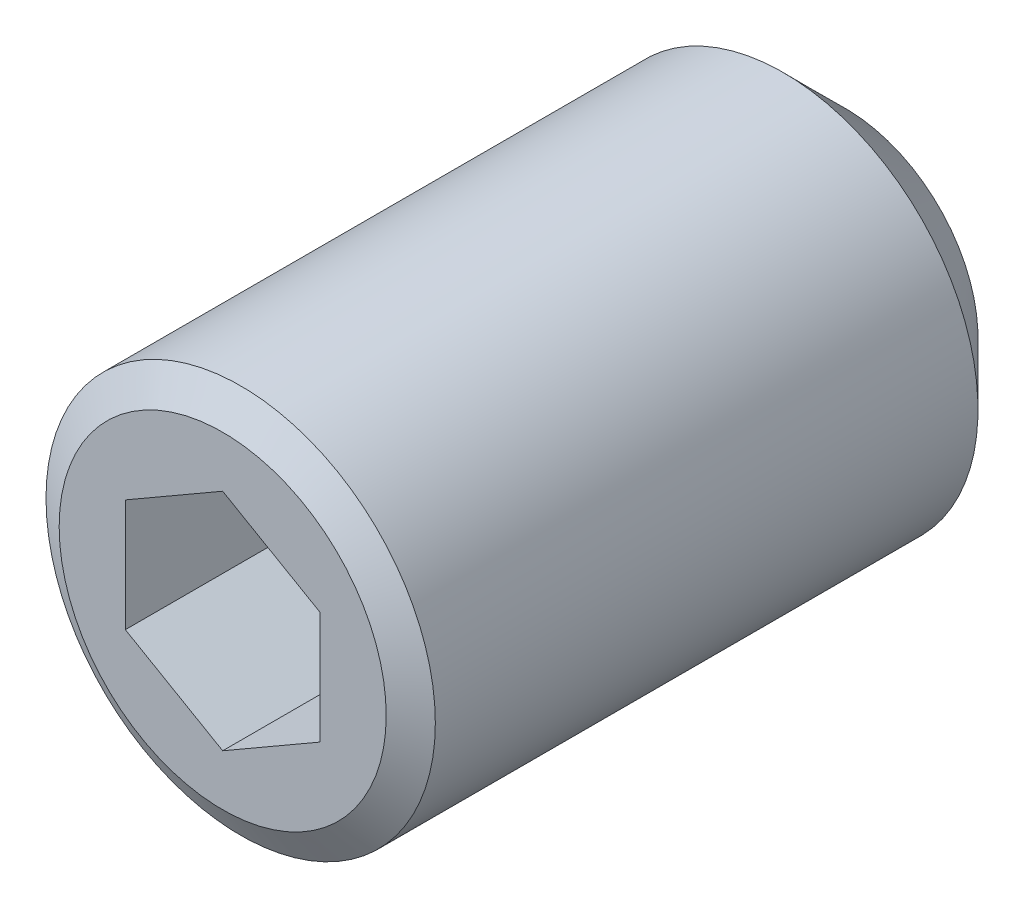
ISO-10303-21;
HEADER;
FILE_DESCRIPTION(('STEP AP214'),'2;1');
FILE_NAME('part.step','',(''),(''),'','','');
FILE_SCHEMA(('AUTOMOTIVE_DESIGN { 1 0 10303 214 1 1 1 1 }'));
ENDSEC;
DATA;
#1=APPLICATION_CONTEXT('core data for automotive mechanical design processes');
#2=APPLICATION_PROTOCOL_DEFINITION('international standard','automotive_design',2000,#1);
#3=PRODUCT_CONTEXT('',#1,'mechanical');
#4=PRODUCT('Part','Part','',(#3));
#5=PRODUCT_RELATED_PRODUCT_CATEGORY('part','',(#4));
#6=PRODUCT_DEFINITION_FORMATION('','',#4);
#7=PRODUCT_DEFINITION_CONTEXT('part definition',#1,'design');
#8=PRODUCT_DEFINITION('design','',#6,#7);
#9=PRODUCT_DEFINITION_SHAPE('','',#8);
#10=(LENGTH_UNIT() NAMED_UNIT(*) SI_UNIT(.MILLI.,.METRE.));
#11=(NAMED_UNIT(*) PLANE_ANGLE_UNIT() SI_UNIT($,.RADIAN.));
#12=(NAMED_UNIT(*) SI_UNIT($,.STERADIAN.) SOLID_ANGLE_UNIT());
#13=UNCERTAINTY_MEASURE_WITH_UNIT(LENGTH_MEASURE(1.E-05),#10,'distance_accuracy_value','');
#14=(GEOMETRIC_REPRESENTATION_CONTEXT(3) GLOBAL_UNCERTAINTY_ASSIGNED_CONTEXT((#13)) GLOBAL_UNIT_ASSIGNED_CONTEXT((#10,
#11,#12)) REPRESENTATION_CONTEXT('',''));
#15=CARTESIAN_POINT('',(0.,0.,0.));
#16=DIRECTION('',(0.,0.,1.));
#17=DIRECTION('',(1.,0.,0.));
#18=AXIS2_PLACEMENT_3D('',#15,#16,#17);
#19=CARTESIAN_POINT('',(0.,0.,8.));
#20=DIRECTION('',(0.,0.,1.));
#21=DIRECTION('',(1.,0.,0.));
#22=AXIS2_PLACEMENT_3D('',#19,#20,#21);
#23=PLANE('',#22);
#24=DIRECTION('',(0.866025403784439,-0.5,0.));
#25=VECTOR('',#24,1.);
#26=CARTESIAN_POINT('',(-1.25,-0.721687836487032,8.));
#27=LINE('',#26,#25);
#28=CARTESIAN_POINT('',(-1.25,-0.721687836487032,8.));
#29=VERTEX_POINT('',#28);
#30=CARTESIAN_POINT('',(0.,-1.44337567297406,8.));
#31=VERTEX_POINT('',#30);
#32=EDGE_CURVE('E29',#29,#31,#27,.T.);
#33=ORIENTED_EDGE('',*,*,#32,.F.);
#34=DIRECTION('',(0.,-1.,0.));
#35=VECTOR('',#34,1.);
#36=CARTESIAN_POINT('',(-1.25,0.721687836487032,8.));
#37=LINE('',#36,#35);
#38=CARTESIAN_POINT('',(-1.25,0.721687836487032,8.));
#39=VERTEX_POINT('',#38);
#40=EDGE_CURVE('E112',#39,#29,#37,.T.);
#41=ORIENTED_EDGE('',*,*,#40,.F.);
#42=DIRECTION('',(-0.866025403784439,-0.5,0.));
#43=VECTOR('',#42,1.);
#44=CARTESIAN_POINT('',(0.,1.44337567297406,8.));
#45=LINE('',#44,#43);
#46=CARTESIAN_POINT('',(0.,1.44337567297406,8.));
#47=VERTEX_POINT('',#46);
#48=EDGE_CURVE('E110',#47,#39,#45,.T.);
#49=ORIENTED_EDGE('',*,*,#48,.F.);
#50=DIRECTION('',(-0.866025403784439,0.5,0.));
#51=VECTOR('',#50,1.);
#52=CARTESIAN_POINT('',(1.25,0.721687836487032,8.));
#53=LINE('',#52,#51);
#54=CARTESIAN_POINT('',(1.25,0.721687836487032,8.));
#55=VERTEX_POINT('',#54);
#56=EDGE_CURVE('E77',#55,#47,#53,.T.);
#57=ORIENTED_EDGE('',*,*,#56,.F.);
#58=DIRECTION('',(0.,1.,0.));
#59=VECTOR('',#58,1.);
#60=CARTESIAN_POINT('',(1.25,-0.721687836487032,8.));
#61=LINE('',#60,#59);
#62=CARTESIAN_POINT('',(1.25,-0.721687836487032,8.));
#63=VERTEX_POINT('',#62);
#64=EDGE_CURVE('E106',#63,#55,#61,.T.);
#65=ORIENTED_EDGE('',*,*,#64,.F.);
#66=DIRECTION('',(0.866025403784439,0.5,0.));
#67=VECTOR('',#66,1.);
#68=CARTESIAN_POINT('',(0.,-1.44337567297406,8.));
#69=LINE('',#68,#67);
#70=EDGE_CURVE('E103',#31,#63,#69,.T.);
#71=ORIENTED_EDGE('',*,*,#70,.F.);
#72=EDGE_LOOP('',(#33,#41,#49,#57,#65,#71));
#73=FACE_BOUND('',#72,.T.);
#74=CARTESIAN_POINT('',(0.,0.,8.));
#75=DIRECTION('',(0.,0.,1.));
#76=DIRECTION('',(1.,0.,0.));
#77=AXIS2_PLACEMENT_3D('',#74,#75,#76);
#78=CIRCLE('',#77,2.1);
#79=CARTESIAN_POINT('',(2.1,0.,8.));
#80=VERTEX_POINT('',#79);
#81=EDGE_CURVE('E9',#80,#80,#78,.T.);
#82=ORIENTED_EDGE('',*,*,#81,.T.);
#83=EDGE_LOOP('',(#82));
#84=FACE_BOUND('',#83,.T.);
#85=ADVANCED_FACE('F14',(#73,#84),#23,.T.);
#86=CARTESIAN_POINT('',(0.,0.,-14.2247720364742));
#87=DIRECTION('',(0.,0.,-1.));
#88=DIRECTION('',(-1.,0.,0.));
#89=AXIS2_PLACEMENT_3D('',#86,#87,#88);
#90=CYLINDRICAL_SURFACE('',#89,2.5);
#91=CARTESIAN_POINT('',(0.,0.,7.76905989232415));
#92=DIRECTION('',(0.,0.,1.));
#93=DIRECTION('',(1.,0.,0.));
#94=AXIS2_PLACEMENT_3D('',#91,#92,#93);
#95=CIRCLE('',#94,2.5);
#96=CARTESIAN_POINT('',(2.5,0.,7.76905989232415));
#97=VERTEX_POINT('',#96);
#98=EDGE_CURVE('E22',#97,#97,#95,.F.);
#99=ORIENTED_EDGE('',*,*,#98,.T.);
#100=EDGE_LOOP('',(#99));
#101=FACE_BOUND('',#100,.T.);
#102=CARTESIAN_POINT('',(0.,0.,0.8));
#103=DIRECTION('',(0.,0.,-1.));
#104=DIRECTION('',(-1.,0.,0.));
#105=AXIS2_PLACEMENT_3D('',#102,#103,#104);
#106=CIRCLE('',#105,2.5);
#107=CARTESIAN_POINT('',(-2.5,0.,0.8));
#108=VERTEX_POINT('',#107);
#109=EDGE_CURVE('E124',#108,#108,#106,.F.);
#110=ORIENTED_EDGE('',*,*,#109,.T.);
#111=EDGE_LOOP('',(#110));
#112=FACE_BOUND('',#111,.T.);
#113=ADVANCED_FACE('F129',(#101,#112),#90,.T.);
#114=CARTESIAN_POINT('',(0.,0.,0.));
#115=DIRECTION('',(0.,0.,-1.));
#116=DIRECTION('',(-1.,0.,0.));
#117=AXIS2_PLACEMENT_3D('',#114,#115,#116);
#118=PLANE('',#117);
#119=CARTESIAN_POINT('',(0.,0.,0.));
#120=DIRECTION('',(0.,0.,-1.));
#121=DIRECTION('',(-1.,0.,0.));
#122=AXIS2_PLACEMENT_3D('',#119,#120,#121);
#123=CIRCLE('',#122,1.7);
#124=CARTESIAN_POINT('',(-1.7,0.,0.));
#125=VERTEX_POINT('',#124);
#126=EDGE_CURVE('E116',#125,#125,#123,.T.);
#127=ORIENTED_EDGE('',*,*,#126,.T.);
#128=EDGE_LOOP('',(#127));
#129=FACE_BOUND('',#128,.T.);
#130=ADVANCED_FACE('F144',(#129),#118,.T.);
#131=CARTESIAN_POINT('',(0.,0.,0.));
#132=DIRECTION('',(0.,0.,1.));
#133=DIRECTION('',(1.,0.,0.));
#134=AXIS2_PLACEMENT_3D('',#131,#132,#133);
#135=CONICAL_SURFACE('',#134,1.7,0.785398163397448);
#136=ORIENTED_EDGE('',*,*,#109,.F.);
#137=EDGE_LOOP('',(#136));
#138=FACE_BOUND('',#137,.T.);
#139=ORIENTED_EDGE('',*,*,#126,.F.);
#140=EDGE_LOOP('',(#139));
#141=FACE_BOUND('',#140,.T.);
#142=ADVANCED_FACE('F134',(#138,#141),#135,.T.);
#143=CARTESIAN_POINT('',(0.,0.,7.76905989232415));
#144=DIRECTION('',(0.,0.,-1.));
#145=DIRECTION('',(-1.,0.,0.));
#146=AXIS2_PLACEMENT_3D('',#143,#144,#145);
#147=CONICAL_SURFACE('',#146,2.5,1.0471975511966);
#148=ORIENTED_EDGE('',*,*,#81,.F.);
#149=EDGE_LOOP('',(#148));
#150=FACE_BOUND('',#149,.T.);
#151=ORIENTED_EDGE('',*,*,#98,.F.);
#152=EDGE_LOOP('',(#151));
#153=FACE_BOUND('',#152,.T.);
#154=ADVANCED_FACE('F16',(#150,#153),#147,.T.);
#155=CARTESIAN_POINT('',(-1.25,-0.721687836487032,5.));
#156=DIRECTION('',(-0.5,-0.866025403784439,0.));
#157=DIRECTION('',(-0.866025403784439,0.5,0.));
#158=AXIS2_PLACEMENT_3D('',#155,#156,#157);
#159=PLANE('',#158);
#160=ORIENTED_EDGE('',*,*,#32,.T.);
#161=DIRECTION('',(0.,0.,1.));
#162=VECTOR('',#161,1.);
#163=CARTESIAN_POINT('',(0.,-1.44337567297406,5.));
#164=LINE('',#163,#162);
#165=CARTESIAN_POINT('',(0.,-1.44337567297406,5.));
#166=VERTEX_POINT('',#165);
#167=EDGE_CURVE('E59',#166,#31,#164,.T.);
#168=ORIENTED_EDGE('',*,*,#167,.F.);
#169=DIRECTION('',(0.866025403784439,-0.5,0.));
#170=VECTOR('',#169,1.);
#171=CARTESIAN_POINT('',(-1.25,-0.721687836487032,5.));
#172=LINE('',#171,#170);
#173=CARTESIAN_POINT('',(-1.25,-0.721687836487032,5.));
#174=VERTEX_POINT('',#173);
#175=EDGE_CURVE('E114',#174,#166,#172,.T.);
#176=ORIENTED_EDGE('',*,*,#175,.F.);
#177=DIRECTION('',(0.,0.,1.));
#178=VECTOR('',#177,1.);
#179=CARTESIAN_POINT('',(-1.25,-0.721687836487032,5.));
#180=LINE('',#179,#178);
#181=EDGE_CURVE('E37',#174,#29,#180,.T.);
#182=ORIENTED_EDGE('',*,*,#181,.T.);
#183=EDGE_LOOP('',(#160,#168,#176,#182));
#184=FACE_BOUND('',#183,.T.);
#185=ADVANCED_FACE('F133',(#184),#159,.F.);
#186=CARTESIAN_POINT('',(-1.25,0.721687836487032,5.));
#187=DIRECTION('',(-1.,0.,0.));
#188=DIRECTION('',(0.,0.,1.));
#189=AXIS2_PLACEMENT_3D('',#186,#187,#188);
#190=PLANE('',#189);
#191=ORIENTED_EDGE('',*,*,#40,.T.);
#192=ORIENTED_EDGE('',*,*,#181,.F.);
#193=DIRECTION('',(0.,-1.,0.));
#194=VECTOR('',#193,1.);
#195=CARTESIAN_POINT('',(-1.25,0.721687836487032,5.));
#196=LINE('',#195,#194);
#197=CARTESIAN_POINT('',(-1.25,0.721687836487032,5.));
#198=VERTEX_POINT('',#197);
#199=EDGE_CURVE('E89',#198,#174,#196,.T.);
#200=ORIENTED_EDGE('',*,*,#199,.F.);
#201=DIRECTION('',(0.,0.,1.));
#202=VECTOR('',#201,1.);
#203=CARTESIAN_POINT('',(-1.25,0.721687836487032,5.));
#204=LINE('',#203,#202);
#205=EDGE_CURVE('E81',#198,#39,#204,.T.);
#206=ORIENTED_EDGE('',*,*,#205,.T.);
#207=EDGE_LOOP('',(#191,#192,#200,#206));
#208=FACE_BOUND('',#207,.T.);
#209=ADVANCED_FACE('F142',(#208),#190,.F.);
#210=CARTESIAN_POINT('',(0.,1.44337567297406,5.));
#211=DIRECTION('',(-0.5,0.866025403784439,0.));
#212=DIRECTION('',(0.866025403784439,0.5,0.));
#213=AXIS2_PLACEMENT_3D('',#210,#211,#212);
#214=PLANE('',#213);
#215=ORIENTED_EDGE('',*,*,#48,.T.);
#216=ORIENTED_EDGE('',*,*,#205,.F.);
#217=DIRECTION('',(-0.866025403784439,-0.5,0.));
#218=VECTOR('',#217,1.);
#219=CARTESIAN_POINT('',(0.,1.44337567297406,5.));
#220=LINE('',#219,#218);
#221=CARTESIAN_POINT('',(0.,1.44337567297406,5.));
#222=VERTEX_POINT('',#221);
#223=EDGE_CURVE('E85',#222,#198,#220,.T.);
#224=ORIENTED_EDGE('',*,*,#223,.F.);
#225=DIRECTION('',(0.,0.,1.));
#226=VECTOR('',#225,1.);
#227=CARTESIAN_POINT('',(0.,1.44337567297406,5.));
#228=LINE('',#227,#226);
#229=EDGE_CURVE('E70',#222,#47,#228,.T.);
#230=ORIENTED_EDGE('',*,*,#229,.T.);
#231=EDGE_LOOP('',(#215,#216,#224,#230));
#232=FACE_BOUND('',#231,.T.);
#233=ADVANCED_FACE('F86',(#232),#214,.F.);
#234=CARTESIAN_POINT('',(1.25,0.721687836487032,5.));
#235=DIRECTION('',(0.5,0.866025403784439,0.));
#236=DIRECTION('',(0.866025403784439,-0.5,0.));
#237=AXIS2_PLACEMENT_3D('',#234,#235,#236);
#238=PLANE('',#237);
#239=ORIENTED_EDGE('',*,*,#56,.T.);
#240=ORIENTED_EDGE('',*,*,#229,.F.);
#241=DIRECTION('',(-0.866025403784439,0.5,0.));
#242=VECTOR('',#241,1.);
#243=CARTESIAN_POINT('',(1.25,0.721687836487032,5.));
#244=LINE('',#243,#242);
#245=CARTESIAN_POINT('',(1.25,0.721687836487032,5.));
#246=VERTEX_POINT('',#245);
#247=EDGE_CURVE('E74',#246,#222,#244,.T.);
#248=ORIENTED_EDGE('',*,*,#247,.F.);
#249=DIRECTION('',(0.,0.,1.));
#250=VECTOR('',#249,1.);
#251=CARTESIAN_POINT('',(1.25,0.721687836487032,5.));
#252=LINE('',#251,#250);
#253=EDGE_CURVE('E82',#246,#55,#252,.T.);
#254=ORIENTED_EDGE('',*,*,#253,.T.);
#255=EDGE_LOOP('',(#239,#240,#248,#254));
#256=FACE_BOUND('',#255,.T.);
#257=ADVANCED_FACE('F72',(#256),#238,.F.);
#258=CARTESIAN_POINT('',(1.25,-0.721687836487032,5.));
#259=DIRECTION('',(1.,0.,0.));
#260=DIRECTION('',(0.,-1.,0.));
#261=AXIS2_PLACEMENT_3D('',#258,#259,#260);
#262=PLANE('',#261);
#263=ORIENTED_EDGE('',*,*,#64,.T.);
#264=ORIENTED_EDGE('',*,*,#253,.F.);
#265=DIRECTION('',(0.,1.,0.));
#266=VECTOR('',#265,1.);
#267=CARTESIAN_POINT('',(1.25,-0.721687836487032,5.));
#268=LINE('',#267,#266);
#269=CARTESIAN_POINT('',(1.25,-0.721687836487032,5.));
#270=VERTEX_POINT('',#269);
#271=EDGE_CURVE('E95',#270,#246,#268,.T.);
#272=ORIENTED_EDGE('',*,*,#271,.F.);
#273=DIRECTION('',(0.,0.,1.));
#274=VECTOR('',#273,1.);
#275=CARTESIAN_POINT('',(1.25,-0.721687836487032,5.));
#276=LINE('',#275,#274);
#277=EDGE_CURVE('E119',#270,#63,#276,.T.);
#278=ORIENTED_EDGE('',*,*,#277,.T.);
#279=EDGE_LOOP('',(#263,#264,#272,#278));
#280=FACE_BOUND('',#279,.T.);
#281=ADVANCED_FACE('F163',(#280),#262,.F.);
#282=CARTESIAN_POINT('',(0.,-1.44337567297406,5.));
#283=DIRECTION('',(0.5,-0.866025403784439,0.));
#284=DIRECTION('',(-0.866025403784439,-0.5,0.));
#285=AXIS2_PLACEMENT_3D('',#282,#283,#284);
#286=PLANE('',#285);
#287=ORIENTED_EDGE('',*,*,#70,.T.);
#288=ORIENTED_EDGE('',*,*,#277,.F.);
#289=DIRECTION('',(0.866025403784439,0.5,0.));
#290=VECTOR('',#289,1.);
#291=CARTESIAN_POINT('',(0.,-1.44337567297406,5.));
#292=LINE('',#291,#290);
#293=EDGE_CURVE('E97',#166,#270,#292,.T.);
#294=ORIENTED_EDGE('',*,*,#293,.F.);
#295=ORIENTED_EDGE('',*,*,#167,.T.);
#296=EDGE_LOOP('',(#287,#288,#294,#295));
#297=FACE_BOUND('',#296,.T.);
#298=ADVANCED_FACE('F160',(#297),#286,.F.);
#299=CARTESIAN_POINT('',(-1.25,-0.721687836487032,5.));
#300=DIRECTION('',(0.,0.,-1.));
#301=DIRECTION('',(-1.,0.,0.));
#302=AXIS2_PLACEMENT_3D('',#299,#300,#301);
#303=PLANE('',#302);
#304=ORIENTED_EDGE('',*,*,#175,.T.);
#305=ORIENTED_EDGE('',*,*,#293,.T.);
#306=ORIENTED_EDGE('',*,*,#271,.T.);
#307=ORIENTED_EDGE('',*,*,#247,.T.);
#308=ORIENTED_EDGE('',*,*,#223,.T.);
#309=ORIENTED_EDGE('',*,*,#199,.T.);
#310=EDGE_LOOP('',(#304,#305,#306,#307,#308,#309));
#311=FACE_BOUND('',#310,.T.);
#312=ADVANCED_FACE('F92',(#311),#303,.F.);
#313=CLOSED_SHELL('',(#85,#113,#130,#142,#154,#185,#209,#233,#257,#281,#298,#312));
#314=MANIFOLD_SOLID_BREP('B1',#313);
#315=ADVANCED_BREP_SHAPE_REPRESENTATION('',(#18,#314),#14);
#316=SHAPE_DEFINITION_REPRESENTATION(#9,#315);
ENDSEC;
END-ISO-10303-21;
